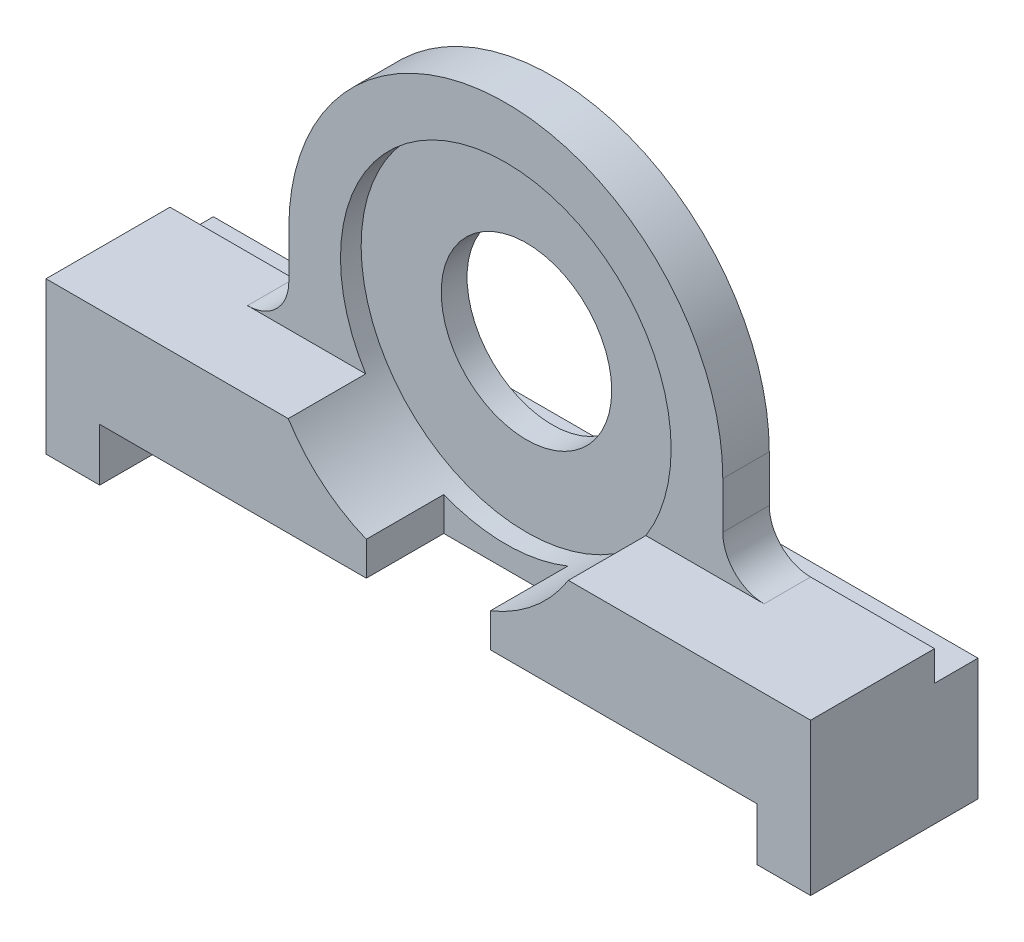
from build123d import *

# Parameters (mm, degrees)
SKETCH2_R           = 16
BOSS_EXTRUDE1_DEPTH = 12
SKETCH3_R           = 16
SKETCH3_R_2         = 8.25
BOSS_EXTRUDE2_DEPTH = 2.5
CUT_EXTRUDE4_DEPTH  = 1
CUT_EXTRUDE5_REACH  = 60.683
SKETCH9_W           = 43.6
SKETCH9_H           = 5.1
SKETCH10_R          = 1.25
CUT_EXTRUDE6_DEPTH  = 9
CUT_EXTRUDE7_START  = -7.5
CUT_EXTRUDE7_DEPTH  = 7.5
FILETE1_R           = 2
FILETE2_R           = 4
SKETCH12_W          = 10
SKETCH12_H          = 5.1
CUT_EXTRUDE8_DEPTH  = 7
SKETCH15_W          = 12
SKETCH15_H          = 3.267603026
CUT_EXTRUDE10_DEPTH = 7.5
BOSS_EXTRUDE3_DEPTH = 4.2


with BuildPart() as part:
    # Sketch2 → Boss-Extrude1 (new body)
    with BuildSketch(Plane.XY):
        with BuildLine():
            Line((-21, 0), (21, 0))
            Line((21, 0), (37, 0))
            Line((37, 0), (37, 14.7))
            Line((37, 14.7), (21, 14.7))
            Line((21, 14.7), (21, 23.2))
            ThreePointArc((21, 23.2), (0, 44.2), (-21, 23.2))
            Line((-21, 23.2), (-21, 14.7))
            Line((-21, 14.7), (-37, 14.7))
            Line((-37, 14.7), (-37, 0))
            Line((-37, 0), (-21, 0))
        make_face()
        with Locations((0, 23.2)):
            Circle(SKETCH2_R, mode=Mode.SUBTRACT)
    extrude(amount=BOSS_EXTRUDE1_DEPTH)

    # Sketch3 → Boss-Extrude2 (add)
    with BuildSketch(Plane.XY):
        with Locations((0, 23.2)):
            Circle(SKETCH3_R)
        with Locations((0, 23.2)):
            Circle(SKETCH3_R_2, mode=Mode.SUBTRACT)
    extrude(amount=BOSS_EXTRUDE2_DEPTH)

    # Sketch8 → Cut-Extrude4 (cut)
    with BuildSketch(Plane.XY):
        Polygon((-27, 0), (27, 0), (33.88, 0), (33.88, 7.2), (27, 7.2), (27, 10.6), (-27, 10.6), (-27, 7.2), (-33.88, 7.2), (-33.88, 0), align=None)
    extrude(amount=CUT_EXTRUDE4_DEPTH, mode=Mode.SUBTRACT)

    # Sketch9 → Cut-Extrude5 (cut, up to next)
    with BuildSketch(Plane(origin=(0, 0, 1), x_dir=(-1, 0, 0), z_dir=(0, 0, -1)), mode=Mode.PRIVATE) as cut_extrude5_sk1:
        with Locations((0, 2.55)):
            Rectangle(SKETCH9_W, SKETCH9_H)
    cut_extrude5_tool1 = extrude(cut_extrude5_sk1.sketch, amount=-CUT_EXTRUDE5_REACH, mode=Mode.PRIVATE) & part.part
    add(cut_extrude5_tool1.solids().sort_by_distance((0, 2.55, 1))[0], mode=Mode.SUBTRACT)

    # Sketch10 → Cut-Extrude6 (cut)
    with BuildSketch(Plane.XZ):
        with Locations((-34, 9)):
            Circle(SKETCH10_R)
        with Locations((-34, 3)):
            Circle(SKETCH10_R)
        with Locations(Location((34, 3, 0), (0, 0, 180))):
            Circle(SKETCH10_R)
        with Locations(Location((34, 9, 0), (0, 0, 180))):
            Circle(SKETCH10_R)
    extrude(amount=-CUT_EXTRUDE6_DEPTH, mode=Mode.SUBTRACT)

    # Sketch11 → Cut-Extrude7 (cut)
    with BuildSketch(Plane.XY.offset(12).offset(CUT_EXTRUDE7_START)):
        with BuildLine():
            Line((21, 14.7), (21, 23.2))
            ThreePointArc((21, 23.2), (0, 44.2), (-21, 23.2))
            Line((-21, 23.2), (-21, 14.7))
            Line((-21, 14.7), (21, 14.7))
        make_face()
    extrude(amount=CUT_EXTRUDE7_DEPTH, mode=Mode.SUBTRACT)

    # Filete1
    filete1_edges = [part.edges().sort_by_distance(p)[0] for p in [
        (27, 10.6, 0.5),
        (-27, 10.6, 0.5),
    ]]
    fillet(filete1_edges, radius=FILETE1_R)

    # Filete2
    filete2_edges = [part.edges().sort_by_distance(p)[0] for p in [
        (-21, 14.7, 2.25),
        (21, 14.7, 2.25),
    ]]
    fillet(filete2_edges, radius=FILETE2_R)

    # Sketch12 → Cut-Extrude8 (cut)
    with BuildSketch(Plane.XY.offset(12)):
        with Locations((26.8, 2.55)):
            Rectangle(SKETCH12_W, SKETCH12_H)
        with Locations((-26.8, 2.55)):
            Rectangle(SKETCH12_W, SKETCH12_H)
    extrude(amount=-CUT_EXTRUDE8_DEPTH, mode=Mode.SUBTRACT)

    # Sketch15 → Cut-Extrude10 (cut)
    with BuildSketch(Plane.XY.offset(12)):
        with Locations((0, 6.733801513)):
            Rectangle(SKETCH15_W, SKETCH15_H)
    extrude(amount=-CUT_EXTRUDE10_DEPTH, mode=Mode.SUBTRACT)

    # Sketch16 → Boss-Extrude3 (add)
    with BuildSketch(Plane(origin=(0, 0, 0), x_dir=(-1, 0, 0), z_dir=(0, 0, -1))):
        with BuildLine():
            Line((-37, 11.8), (37, 11.8))
            Line((37, 11.8), (37, 0))
            Line((37, 0), (33.88, 0))
            Line((33.88, 0), (33.88, 7.2))
            Line((33.88, 7.2), (27, 7.2))
            Line((27, 7.2), (27, 8.6))
            ThreePointArc((27, 8.6), (26.414213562, 10.014213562), (25, 10.6))
            Line((25, 10.6), (-25, 10.6))
            ThreePointArc((-25, 10.6), (-26.414213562, 10.014213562), (-27, 8.6))
            Line((-27, 8.6), (-27, 7.2))
            Line((-27, 7.2), (-33.88, 7.2))
            Line((-33.88, 7.2), (-33.88, 0))
            Line((-33.88, 0), (-37, 0))
            Line((-37, 0), (-37, 11.8))
        make_face()
    extrude(amount=BOSS_EXTRUDE3_DEPTH)


solid = part.part
